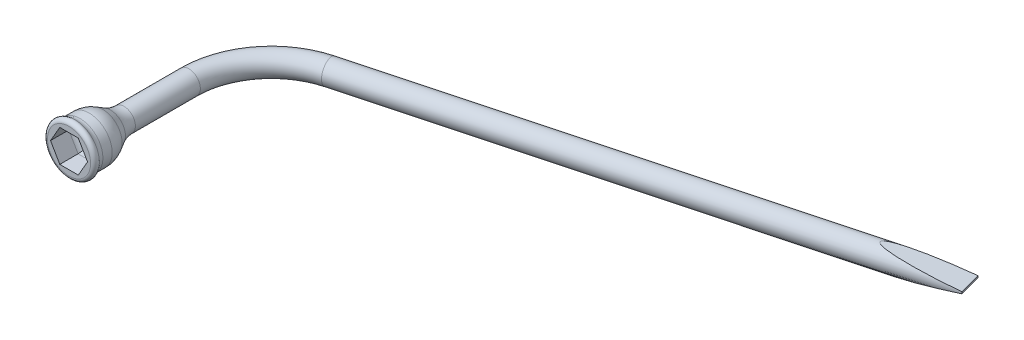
ISO-10303-21;
HEADER;
FILE_DESCRIPTION(('STEP AP214'),'2;1');
FILE_NAME('part.step','',(''),(''),'','','');
FILE_SCHEMA(('AUTOMOTIVE_DESIGN { 1 0 10303 214 1 1 1 1 }'));
ENDSEC;
DATA;
#1=APPLICATION_CONTEXT('core data for automotive mechanical design processes');
#2=APPLICATION_PROTOCOL_DEFINITION('international standard','automotive_design',2000,#1);
#3=PRODUCT_CONTEXT('',#1,'mechanical');
#4=PRODUCT('Part','Part','',(#3));
#5=PRODUCT_RELATED_PRODUCT_CATEGORY('part','',(#4));
#6=PRODUCT_DEFINITION_FORMATION('','',#4);
#7=PRODUCT_DEFINITION_CONTEXT('part definition',#1,'design');
#8=PRODUCT_DEFINITION('design','',#6,#7);
#9=PRODUCT_DEFINITION_SHAPE('','',#8);
#10=(LENGTH_UNIT() NAMED_UNIT(*) SI_UNIT(.MILLI.,.METRE.));
#11=(NAMED_UNIT(*) PLANE_ANGLE_UNIT() SI_UNIT($,.RADIAN.));
#12=(NAMED_UNIT(*) SI_UNIT($,.STERADIAN.) SOLID_ANGLE_UNIT());
#13=UNCERTAINTY_MEASURE_WITH_UNIT(LENGTH_MEASURE(1.E-05),#10,'distance_accuracy_value','');
#14=(GEOMETRIC_REPRESENTATION_CONTEXT(3) GLOBAL_UNCERTAINTY_ASSIGNED_CONTEXT((#13)) GLOBAL_UNIT_ASSIGNED_CONTEXT((#10,
#11,#12)) REPRESENTATION_CONTEXT('',''));
#15=CARTESIAN_POINT('',(0.,0.,0.));
#16=DIRECTION('',(0.,0.,1.));
#17=DIRECTION('',(1.,0.,0.));
#18=AXIS2_PLACEMENT_3D('',#15,#16,#17);
#19=CARTESIAN_POINT('',(392.552255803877,0.,-232.184059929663));
#20=DIRECTION('',(-0.965925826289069,0.,0.258819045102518));
#21=DIRECTION('',(0.258819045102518,0.,0.965925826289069));
#22=AXIS2_PLACEMENT_3D('',#19,#20,#21);
#23=PLANE('',#22);
#24=CARTESIAN_POINT('',(392.552255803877,0.,-232.184059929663));
#25=DIRECTION('',(-0.965925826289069,0.,0.258819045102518));
#26=DIRECTION('',(0.258819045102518,0.,0.965925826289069));
#27=AXIS2_PLACEMENT_3D('',#24,#25,#26);
#28=CIRCLE('',#27,7.93750000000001);
#29=CARTESIAN_POINT('',(390.504464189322,0.63499999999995,-239.826522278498));
#30=VERTEX_POINT('',#29);
#31=CARTESIAN_POINT('',(390.504464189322,-0.635,-239.826522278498));
#32=VERTEX_POINT('',#31);
#33=EDGE_CURVE('E118',#30,#32,#28,.T.);
#34=ORIENTED_EDGE('',*,*,#33,.F.);
#35=DIRECTION('',(0.258819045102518,0.,0.965925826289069));
#36=VECTOR('',#35,1.);
#37=CARTESIAN_POINT('',(363.169716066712,0.635,-341.841191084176));
#38=LINE('',#37,#36);
#39=CARTESIAN_POINT('',(394.600047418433,0.635,-224.541597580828));
#40=VERTEX_POINT('',#39);
#41=EDGE_CURVE('E65',#30,#40,#38,.T.);
#42=ORIENTED_EDGE('',*,*,#41,.T.);
#43=CARTESIAN_POINT('',(394.606631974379,0.,-224.517023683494));
#44=VERTEX_POINT('',#43);
#45=EDGE_CURVE('E115',#44,#40,#28,.T.);
#46=ORIENTED_EDGE('',*,*,#45,.F.);
#47=CARTESIAN_POINT('',(394.600047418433,-0.634999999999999,-224.541597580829));
#48=VERTEX_POINT('',#47);
#49=EDGE_CURVE('E120',#48,#44,#28,.T.);
#50=ORIENTED_EDGE('',*,*,#49,.F.);
#51=DIRECTION('',(0.258819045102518,0.,0.965925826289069));
#52=VECTOR('',#51,1.);
#53=CARTESIAN_POINT('',(363.169716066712,-0.635,-341.841191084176));
#54=LINE('',#53,#52);
#55=EDGE_CURVE('E58',#32,#48,#54,.T.);
#56=ORIENTED_EDGE('',*,*,#55,.F.);
#57=EDGE_LOOP('',(#34,#42,#46,#50,#56));
#58=FACE_BOUND('',#57,.T.);
#59=ADVANCED_FACE('F44',(#58),#23,.F.);
#60=CARTESIAN_POINT('',(0.,0.,0.));
#61=DIRECTION('',(0.,0.,-1.));
#62=DIRECTION('',(-1.,0.,0.));
#63=AXIS2_PLACEMENT_3D('',#60,#61,#62);
#64=CYLINDRICAL_SURFACE('',#63,7.93750000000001);
#65=CARTESIAN_POINT('',(0.,0.,-38.1));
#66=DIRECTION('',(0.,0.,-1.));
#67=DIRECTION('',(-1.,0.,0.));
#68=AXIS2_PLACEMENT_3D('',#65,#66,#67);
#69=CIRCLE('',#68,7.93750000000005);
#70=CARTESIAN_POINT('',(-7.93750000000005,0.,-38.1));
#71=VERTEX_POINT('',#70);
#72=EDGE_CURVE('E151',#71,#71,#69,.T.);
#73=ORIENTED_EDGE('',*,*,#72,.T.);
#74=EDGE_LOOP('',(#73));
#75=FACE_BOUND('',#74,.T.);
#76=CARTESIAN_POINT('',(0.,0.,-83.1472626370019));
#77=DIRECTION('',(0.,0.,1.));
#78=DIRECTION('',(1.,0.,0.));
#79=AXIS2_PLACEMENT_3D('',#76,#77,#78);
#80=CIRCLE('',#79,7.93750000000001);
#81=CARTESIAN_POINT('',(-7.93750000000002,0.,-83.1472626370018));
#82=VERTEX_POINT('',#81);
#83=EDGE_CURVE('E130',#82,#82,#80,.T.);
#84=ORIENTED_EDGE('',*,*,#83,.T.);
#85=EDGE_LOOP('',(#84));
#86=FACE_BOUND('',#85,.T.);
#87=ADVANCED_FACE('F314',(#75,#86),#64,.T.);
#88=CARTESIAN_POINT('',(57.15,0.,-83.1472626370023));
#89=DIRECTION('',(0.,-1.,0.));
#90=DIRECTION('',(0.,0.,-1.));
#91=AXIS2_PLACEMENT_3D('',#88,#89,#90);
#92=TOROIDAL_SURFACE('',#91,57.15,7.93750000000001);
#93=CARTESIAN_POINT('',(42.3584915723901,0.,-138.349923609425));
#94=DIRECTION('',(-0.965925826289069,0.,0.258819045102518));
#95=DIRECTION('',(0.258819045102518,0.,0.965925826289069));
#96=AXIS2_PLACEMENT_3D('',#93,#94,#95);
#97=CIRCLE('',#96,7.93750000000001);
#98=CARTESIAN_POINT('',(40.3041154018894,0.,-146.016959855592));
#99=VERTEX_POINT('',#98);
#100=EDGE_CURVE('E126',#99,#99,#97,.T.);
#101=CARTESIAN_POINT('',(57.15,0.,-83.1472626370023));
#102=DIRECTION('',(0.,-1.,0.));
#103=DIRECTION('',(0.,0.,-1.));
#104=AXIS2_PLACEMENT_3D('',#101,#102,#103);
#105=CIRCLE('',#104,65.0875);
#106=EDGE_CURVE('',#82,#99,#105,.T.);
#107=ORIENTED_EDGE('',*,*,#83,.F.);
#108=ORIENTED_EDGE('',*,*,#100,.T.);
#109=ORIENTED_EDGE('',*,*,#106,.T.);
#110=ORIENTED_EDGE('',*,*,#106,.F.);
#111=EDGE_LOOP('',(#107,#109,#108,#110));
#112=FACE_BOUND('',#111,.T.);
#113=ADVANCED_FACE('F305',(#112),#92,.T.);
#114=CARTESIAN_POINT('',(42.3584915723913,0.,-138.349923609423));
#115=DIRECTION('',(0.965925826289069,0.,-0.258819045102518));
#116=DIRECTION('',(-0.258819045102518,0.,-0.965925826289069));
#117=AXIS2_PLACEMENT_3D('',#114,#115,#116);
#118=CYLINDRICAL_SURFACE('',#117,7.93750000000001);
#119=ORIENTED_EDGE('',*,*,#45,.T.);
#120=CARTESIAN_POINT('',(396.819128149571,0.,-233.327364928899));
#121=DIRECTION('',(-0.137439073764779,-0.98982538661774,0.0368266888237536));
#122=DIRECTION('',(0.956097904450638,-0.1422873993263,-0.256185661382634));
#123=AXIS2_PLACEMENT_3D('',#120,#121,#122);
#124=ELLIPSE('',#123,55.7849819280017,7.93750000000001);
#125=EDGE_CURVE('E12',#40,#30,#124,.T.);
#126=ORIENTED_EDGE('',*,*,#125,.T.);
#127=ORIENTED_EDGE('',*,*,#33,.T.);
#128=CARTESIAN_POINT('',(396.819128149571,0.,-233.327364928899));
#129=DIRECTION('',(-0.137439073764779,0.98982538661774,0.0368266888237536));
#130=DIRECTION('',(0.956097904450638,0.1422873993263,-0.256185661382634));
#131=AXIS2_PLACEMENT_3D('',#128,#129,#130);
#132=ELLIPSE('',#131,55.7849819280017,7.93750000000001);
#133=EDGE_CURVE('E52',#32,#48,#132,.T.);
#134=ORIENTED_EDGE('',*,*,#133,.T.);
#135=ORIENTED_EDGE('',*,*,#49,.T.);
#136=EDGE_LOOP('',(#119,#126,#127,#134,#135));
#137=FACE_BOUND('',#136,.T.);
#138=ORIENTED_EDGE('',*,*,#100,.F.);
#139=EDGE_LOOP('',(#138));
#140=FACE_BOUND('',#139,.T.);
#141=ADVANCED_FACE('F123',(#137,#140),#118,.T.);
#142=CARTESIAN_POINT('',(0.,0.,-2.54));
#143=DIRECTION('',(0.,0.,-1.));
#144=DIRECTION('',(-1.,0.,0.));
#145=AXIS2_PLACEMENT_3D('',#142,#143,#144);
#146=TOROIDAL_SURFACE('',#145,14.9225,2.54);
#147=CARTESIAN_POINT('',(0.,0.,0.));
#148=DIRECTION('',(0.,0.,-1.));
#149=DIRECTION('',(-1.,0.,0.));
#150=AXIS2_PLACEMENT_3D('',#147,#148,#149);
#151=CIRCLE('',#150,14.9225);
#152=CARTESIAN_POINT('',(-14.9225,0.,0.));
#153=VERTEX_POINT('',#152);
#154=EDGE_CURVE('E133',#153,#153,#151,.T.);
#155=ORIENTED_EDGE('',*,*,#154,.T.);
#156=EDGE_LOOP('',(#155));
#157=FACE_BOUND('',#156,.T.);
#158=CARTESIAN_POINT('',(0.,0.,-3.98859097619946));
#159=DIRECTION('',(0.,0.,-1.));
#160=DIRECTION('',(-1.,0.,0.));
#161=AXIS2_PLACEMENT_3D('',#158,#159,#160);
#162=CIRCLE('',#161,17.0089285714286);
#163=CARTESIAN_POINT('',(-17.0089285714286,0.,-3.98859097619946));
#164=VERTEX_POINT('',#163);
#165=EDGE_CURVE('E136',#164,#164,#162,.T.);
#166=ORIENTED_EDGE('',*,*,#165,.F.);
#167=EDGE_LOOP('',(#166));
#168=FACE_BOUND('',#167,.T.);
#169=ADVANCED_FACE('F304',(#157,#168),#146,.T.);
#170=CARTESIAN_POINT('',(0.,0.,-7.61006841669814));
#171=DIRECTION('',(0.,0.,-1.));
#172=DIRECTION('',(-1.,0.,0.));
#173=AXIS2_PLACEMENT_3D('',#170,#171,#172);
#174=TOROIDAL_SURFACE('',#173,22.225,6.35);
#175=ORIENTED_EDGE('',*,*,#165,.T.);
#176=EDGE_LOOP('',(#175));
#177=FACE_BOUND('',#176,.T.);
#178=CARTESIAN_POINT('',(0.,0.,-7.61006841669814));
#179=DIRECTION('',(0.,0.,-1.));
#180=DIRECTION('',(-1.,0.,0.));
#181=AXIS2_PLACEMENT_3D('',#178,#179,#180);
#182=CIRCLE('',#181,15.875);
#183=CARTESIAN_POINT('',(-15.875,0.,-7.61006841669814));
#184=VERTEX_POINT('',#183);
#185=EDGE_CURVE('E139',#184,#184,#182,.T.);
#186=ORIENTED_EDGE('',*,*,#185,.F.);
#187=EDGE_LOOP('',(#186));
#188=FACE_BOUND('',#187,.T.);
#189=ADVANCED_FACE('F311',(#177,#188),#174,.F.);
#190=CARTESIAN_POINT('',(0.,0.,0.));
#191=DIRECTION('',(0.,0.,-1.));
#192=DIRECTION('',(-1.,0.,0.));
#193=AXIS2_PLACEMENT_3D('',#190,#191,#192);
#194=CYLINDRICAL_SURFACE('',#193,15.875);
#195=ORIENTED_EDGE('',*,*,#185,.T.);
#196=EDGE_LOOP('',(#195));
#197=FACE_BOUND('',#196,.T.);
#198=CARTESIAN_POINT('',(0.,0.,-14.0368421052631));
#199=DIRECTION('',(0.,0.,-1.));
#200=DIRECTION('',(-1.,0.,0.));
#201=AXIS2_PLACEMENT_3D('',#198,#199,#200);
#202=CIRCLE('',#201,15.875);
#203=CARTESIAN_POINT('',(-15.875,0.,-14.0368421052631));
#204=VERTEX_POINT('',#203);
#205=EDGE_CURVE('E142',#204,#204,#202,.T.);
#206=ORIENTED_EDGE('',*,*,#205,.F.);
#207=EDGE_LOOP('',(#206));
#208=FACE_BOUND('',#207,.T.);
#209=ADVANCED_FACE('F329',(#197,#208),#194,.T.);
#210=CARTESIAN_POINT('',(0.,0.,-14.0368421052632));
#211=DIRECTION('',(0.,0.,-1.));
#212=DIRECTION('',(-1.,0.,0.));
#213=AXIS2_PLACEMENT_3D('',#210,#211,#212);
#214=DEGENERATE_TOROIDAL_SURFACE('',#213,3.175,19.05,.F.);
#215=ORIENTED_EDGE('',*,*,#205,.T.);
#216=EDGE_LOOP('',(#215));
#217=FACE_BOUND('',#216,.T.);
#218=CARTESIAN_POINT('',(0.,0.,-23.4137851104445));
#219=DIRECTION('',(0.,0.,-1.));
#220=DIRECTION('',(-1.,0.,0.));
#221=AXIS2_PLACEMENT_3D('',#218,#219,#220);
#222=CIRCLE('',#221,13.4073834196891);
#223=CARTESIAN_POINT('',(-13.4073834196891,0.,-23.4137851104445));
#224=VERTEX_POINT('',#223);
#225=EDGE_CURVE('E145',#224,#224,#222,.T.);
#226=ORIENTED_EDGE('',*,*,#225,.F.);
#227=EDGE_LOOP('',(#226));
#228=FACE_BOUND('',#227,.T.);
#229=ADVANCED_FACE('F333',(#217,#228),#214,.F.);
#230=CARTESIAN_POINT('',(0.,0.,-28.7230569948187));
#231=DIRECTION('',(0.,0.,1.));
#232=DIRECTION('',(1.,0.,0.));
#233=AXIS2_PLACEMENT_3D('',#230,#231,#232);
#234=CONICAL_SURFACE('',#233,10.4051165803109,0.514647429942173);
#235=ORIENTED_EDGE('',*,*,#225,.T.);
#236=EDGE_LOOP('',(#235));
#237=FACE_BOUND('',#236,.T.);
#238=CARTESIAN_POINT('',(0.,0.,-28.7230569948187));
#239=DIRECTION('',(0.,0.,-1.));
#240=DIRECTION('',(-1.,0.,0.));
#241=AXIS2_PLACEMENT_3D('',#238,#239,#240);
#242=CIRCLE('',#241,10.4051165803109);
#243=CARTESIAN_POINT('',(-10.4051165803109,0.,-28.7230569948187));
#244=VERTEX_POINT('',#243);
#245=EDGE_CURVE('E148',#244,#244,#242,.T.);
#246=ORIENTED_EDGE('',*,*,#245,.F.);
#247=EDGE_LOOP('',(#246));
#248=FACE_BOUND('',#247,.T.);
#249=ADVANCED_FACE('F337',(#237,#248),#234,.T.);
#250=CARTESIAN_POINT('',(0.,0.,-38.1));
#251=DIRECTION('',(0.,0.,-1.));
#252=DIRECTION('',(-1.,0.,0.));
#253=AXIS2_PLACEMENT_3D('',#250,#251,#252);
#254=TOROIDAL_SURFACE('',#253,26.9875000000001,19.05);
#255=ORIENTED_EDGE('',*,*,#245,.T.);
#256=EDGE_LOOP('',(#255));
#257=FACE_BOUND('',#256,.T.);
#258=ORIENTED_EDGE('',*,*,#72,.F.);
#259=EDGE_LOOP('',(#258));
#260=FACE_BOUND('',#259,.T.);
#261=ADVANCED_FACE('F341',(#257,#260),#254,.F.);
#262=CARTESIAN_POINT('',(0.,0.,0.));
#263=DIRECTION('',(0.,0.,1.));
#264=DIRECTION('',(1.,0.,0.));
#265=AXIS2_PLACEMENT_3D('',#262,#263,#264);
#266=PLANE('',#265);
#267=DIRECTION('',(-0.5,0.866025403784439,0.));
#268=VECTOR('',#267,1.);
#269=CARTESIAN_POINT('',(12.8316097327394,0.,0.));
#270=LINE('',#269,#268);
#271=CARTESIAN_POINT('',(12.8316097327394,0.,0.));
#272=VERTEX_POINT('',#271);
#273=CARTESIAN_POINT('',(6.41580486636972,11.1125,0.));
#274=VERTEX_POINT('',#273);
#275=EDGE_CURVE('E184',#272,#274,#270,.T.);
#276=ORIENTED_EDGE('',*,*,#275,.F.);
#277=DIRECTION('',(0.5,0.866025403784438,0.));
#278=VECTOR('',#277,1.);
#279=CARTESIAN_POINT('',(6.41580486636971,-11.1125,0.));
#280=LINE('',#279,#278);
#281=CARTESIAN_POINT('',(6.41580486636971,-11.1125,0.));
#282=VERTEX_POINT('',#281);
#283=EDGE_CURVE('E168',#282,#272,#280,.T.);
#284=ORIENTED_EDGE('',*,*,#283,.F.);
#285=DIRECTION('',(1.,0.,0.));
#286=VECTOR('',#285,1.);
#287=CARTESIAN_POINT('',(-6.41580486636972,-11.1125,0.));
#288=LINE('',#287,#286);
#289=CARTESIAN_POINT('',(-6.41580486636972,-11.1125,0.));
#290=VERTEX_POINT('',#289);
#291=EDGE_CURVE('E172',#290,#282,#288,.T.);
#292=ORIENTED_EDGE('',*,*,#291,.F.);
#293=DIRECTION('',(0.5,-0.866025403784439,0.));
#294=VECTOR('',#293,1.);
#295=CARTESIAN_POINT('',(-12.8316097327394,0.,0.));
#296=LINE('',#295,#294);
#297=CARTESIAN_POINT('',(-12.8316097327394,0.,0.));
#298=VERTEX_POINT('',#297);
#299=EDGE_CURVE('E175',#298,#290,#296,.T.);
#300=ORIENTED_EDGE('',*,*,#299,.F.);
#301=DIRECTION('',(-0.5,-0.866025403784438,0.));
#302=VECTOR('',#301,1.);
#303=CARTESIAN_POINT('',(-6.41580486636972,11.1125,0.));
#304=LINE('',#303,#302);
#305=CARTESIAN_POINT('',(-6.41580486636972,11.1125,0.));
#306=VERTEX_POINT('',#305);
#307=EDGE_CURVE('E178',#306,#298,#304,.T.);
#308=ORIENTED_EDGE('',*,*,#307,.F.);
#309=DIRECTION('',(-1.,0.,0.));
#310=VECTOR('',#309,1.);
#311=CARTESIAN_POINT('',(6.41580486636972,11.1125,0.));
#312=LINE('',#311,#310);
#313=EDGE_CURVE('E181',#274,#306,#312,.T.);
#314=ORIENTED_EDGE('',*,*,#313,.F.);
#315=EDGE_LOOP('',(#276,#284,#292,#300,#308,#314));
#316=FACE_BOUND('',#315,.T.);
#317=ORIENTED_EDGE('',*,*,#154,.F.);
#318=EDGE_LOOP('',(#317));
#319=FACE_BOUND('',#318,.T.);
#320=ADVANCED_FACE('F46',(#316,#319),#266,.T.);
#321=CARTESIAN_POINT('',(12.8316097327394,0.,-12.7));
#322=DIRECTION('',(0.866025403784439,0.5,0.));
#323=DIRECTION('',(-0.5,0.866025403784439,0.));
#324=AXIS2_PLACEMENT_3D('',#321,#322,#323);
#325=PLANE('',#324);
#326=ORIENTED_EDGE('',*,*,#275,.T.);
#327=DIRECTION('',(0.,0.,1.));
#328=VECTOR('',#327,1.);
#329=CARTESIAN_POINT('',(6.41580486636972,11.1125,-12.7));
#330=LINE('',#329,#328);
#331=CARTESIAN_POINT('',(6.41580486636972,11.1125,-12.7));
#332=VERTEX_POINT('',#331);
#333=EDGE_CURVE('E155',#332,#274,#330,.T.);
#334=ORIENTED_EDGE('',*,*,#333,.F.);
#335=DIRECTION('',(-0.5,0.866025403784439,0.));
#336=VECTOR('',#335,1.);
#337=CARTESIAN_POINT('',(12.8316097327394,0.,-12.7));
#338=LINE('',#337,#336);
#339=CARTESIAN_POINT('',(12.8316097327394,0.,-12.7));
#340=VERTEX_POINT('',#339);
#341=EDGE_CURVE('E171',#340,#332,#338,.T.);
#342=ORIENTED_EDGE('',*,*,#341,.F.);
#343=DIRECTION('',(0.,0.,1.));
#344=VECTOR('',#343,1.);
#345=CARTESIAN_POINT('',(12.8316097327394,0.,-12.7));
#346=LINE('',#345,#344);
#347=EDGE_CURVE('E154',#340,#272,#346,.T.);
#348=ORIENTED_EDGE('',*,*,#347,.T.);
#349=EDGE_LOOP('',(#326,#334,#342,#348));
#350=FACE_BOUND('',#349,.T.);
#351=ADVANCED_FACE('F264',(#350),#325,.F.);
#352=CARTESIAN_POINT('',(6.41580486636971,-11.1125,-12.7));
#353=DIRECTION('',(0.866025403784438,-0.5,0.));
#354=DIRECTION('',(0.5,0.866025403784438,0.));
#355=AXIS2_PLACEMENT_3D('',#352,#353,#354);
#356=PLANE('',#355);
#357=ORIENTED_EDGE('',*,*,#283,.T.);
#358=ORIENTED_EDGE('',*,*,#347,.F.);
#359=DIRECTION('',(0.5,0.866025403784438,0.));
#360=VECTOR('',#359,1.);
#361=CARTESIAN_POINT('',(6.41580486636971,-11.1125,-12.7));
#362=LINE('',#361,#360);
#363=CARTESIAN_POINT('',(6.41580486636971,-11.1125,-12.7));
#364=VERTEX_POINT('',#363);
#365=EDGE_CURVE('E159',#364,#340,#362,.T.);
#366=ORIENTED_EDGE('',*,*,#365,.F.);
#367=DIRECTION('',(0.,0.,1.));
#368=VECTOR('',#367,1.);
#369=CARTESIAN_POINT('',(6.41580486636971,-11.1125,-12.7));
#370=LINE('',#369,#368);
#371=EDGE_CURVE('E165',#364,#282,#370,.T.);
#372=ORIENTED_EDGE('',*,*,#371,.T.);
#373=EDGE_LOOP('',(#357,#358,#366,#372));
#374=FACE_BOUND('',#373,.T.);
#375=ADVANCED_FACE('F260',(#374),#356,.F.);
#376=CARTESIAN_POINT('',(-6.41580486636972,-11.1125,-12.7));
#377=DIRECTION('',(0.,-1.,0.));
#378=DIRECTION('',(1.,0.,0.));
#379=AXIS2_PLACEMENT_3D('',#376,#377,#378);
#380=PLANE('',#379);
#381=ORIENTED_EDGE('',*,*,#291,.T.);
#382=ORIENTED_EDGE('',*,*,#371,.F.);
#383=DIRECTION('',(1.,0.,0.));
#384=VECTOR('',#383,1.);
#385=CARTESIAN_POINT('',(-6.41580486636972,-11.1125,-12.7));
#386=LINE('',#385,#384);
#387=CARTESIAN_POINT('',(-6.41580486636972,-11.1125,-12.7));
#388=VERTEX_POINT('',#387);
#389=EDGE_CURVE('E189',#388,#364,#386,.T.);
#390=ORIENTED_EDGE('',*,*,#389,.F.);
#391=DIRECTION('',(0.,0.,1.));
#392=VECTOR('',#391,1.);
#393=CARTESIAN_POINT('',(-6.41580486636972,-11.1125,-12.7));
#394=LINE('',#393,#392);
#395=EDGE_CURVE('E163',#388,#290,#394,.T.);
#396=ORIENTED_EDGE('',*,*,#395,.T.);
#397=EDGE_LOOP('',(#381,#382,#390,#396));
#398=FACE_BOUND('',#397,.T.);
#399=ADVANCED_FACE('F280',(#398),#380,.F.);
#400=CARTESIAN_POINT('',(-12.8316097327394,0.,-12.7));
#401=DIRECTION('',(-0.866025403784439,-0.5,0.));
#402=DIRECTION('',(0.5,-0.866025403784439,0.));
#403=AXIS2_PLACEMENT_3D('',#400,#401,#402);
#404=PLANE('',#403);
#405=ORIENTED_EDGE('',*,*,#299,.T.);
#406=ORIENTED_EDGE('',*,*,#395,.F.);
#407=DIRECTION('',(0.5,-0.866025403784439,0.));
#408=VECTOR('',#407,1.);
#409=CARTESIAN_POINT('',(-12.8316097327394,0.,-12.7));
#410=LINE('',#409,#408);
#411=CARTESIAN_POINT('',(-12.8316097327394,0.,-12.7));
#412=VERTEX_POINT('',#411);
#413=EDGE_CURVE('E191',#412,#388,#410,.T.);
#414=ORIENTED_EDGE('',*,*,#413,.F.);
#415=DIRECTION('',(0.,0.,1.));
#416=VECTOR('',#415,1.);
#417=CARTESIAN_POINT('',(-12.8316097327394,0.,-12.7));
#418=LINE('',#417,#416);
#419=EDGE_CURVE('E161',#412,#298,#418,.T.);
#420=ORIENTED_EDGE('',*,*,#419,.T.);
#421=EDGE_LOOP('',(#405,#406,#414,#420));
#422=FACE_BOUND('',#421,.T.);
#423=ADVANCED_FACE('F291',(#422),#404,.F.);
#424=CARTESIAN_POINT('',(-6.41580486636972,11.1125,-12.7));
#425=DIRECTION('',(-0.866025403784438,0.5,0.));
#426=DIRECTION('',(-0.5,-0.866025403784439,0.));
#427=AXIS2_PLACEMENT_3D('',#424,#425,#426);
#428=PLANE('',#427);
#429=ORIENTED_EDGE('',*,*,#307,.T.);
#430=ORIENTED_EDGE('',*,*,#419,.F.);
#431=DIRECTION('',(-0.5,-0.866025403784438,0.));
#432=VECTOR('',#431,1.);
#433=CARTESIAN_POINT('',(-6.41580486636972,11.1125,-12.7));
#434=LINE('',#433,#432);
#435=CARTESIAN_POINT('',(-6.41580486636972,11.1125,-12.7));
#436=VERTEX_POINT('',#435);
#437=EDGE_CURVE('E194',#436,#412,#434,.T.);
#438=ORIENTED_EDGE('',*,*,#437,.F.);
#439=DIRECTION('',(0.,0.,1.));
#440=VECTOR('',#439,1.);
#441=CARTESIAN_POINT('',(-6.41580486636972,11.1125,-12.7));
#442=LINE('',#441,#440);
#443=EDGE_CURVE('E158',#436,#306,#442,.T.);
#444=ORIENTED_EDGE('',*,*,#443,.T.);
#445=EDGE_LOOP('',(#429,#430,#438,#444));
#446=FACE_BOUND('',#445,.T.);
#447=ADVANCED_FACE('F288',(#446),#428,.F.);
#448=CARTESIAN_POINT('',(6.41580486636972,11.1125,-12.7));
#449=DIRECTION('',(0.,1.,0.));
#450=DIRECTION('',(0.,0.,1.));
#451=AXIS2_PLACEMENT_3D('',#448,#449,#450);
#452=PLANE('',#451);
#453=ORIENTED_EDGE('',*,*,#313,.T.);
#454=ORIENTED_EDGE('',*,*,#443,.F.);
#455=DIRECTION('',(-1.,0.,0.));
#456=VECTOR('',#455,1.);
#457=CARTESIAN_POINT('',(6.41580486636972,11.1125,-12.7));
#458=LINE('',#457,#456);
#459=EDGE_CURVE('E197',#332,#436,#458,.T.);
#460=ORIENTED_EDGE('',*,*,#459,.F.);
#461=ORIENTED_EDGE('',*,*,#333,.T.);
#462=EDGE_LOOP('',(#453,#454,#460,#461));
#463=FACE_BOUND('',#462,.T.);
#464=ADVANCED_FACE('F269',(#463),#452,.F.);
#465=CARTESIAN_POINT('',(-6.41580486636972,-11.1125,-12.7));
#466=CARTESIAN_POINT('',(-6.09501462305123,-10.556875,-19.05));
#467=CARTESIAN_POINT('',(0.,0.,-19.05));
#468=CARTESIAN_POINT('',(6.41580486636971,-11.1125,-12.7));
#469=CARTESIAN_POINT('',(6.09501462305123,-10.556875,-19.05));
#470=CARTESIAN_POINT('',(0.,0.,-19.05));
#471=(BOUNDED_SURFACE() B_SPLINE_SURFACE(1,2,((#465,#466,#467),(#468,#469,#470)),.UNSPECIFIED.,
.F.,.F.,.F.) B_SPLINE_SURFACE_WITH_KNOTS((2,2),(3,3),(0.,1.),(0.,1.),
.UNSPECIFIED.) GEOMETRIC_REPRESENTATION_ITEM() RATIONAL_B_SPLINE_SURFACE(((1.,1.,1.),(1.,1.,1.))) REPRESENTATION_ITEM('') SURFACE());
#472=CARTESIAN_POINT('',(6.41580486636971,-11.1125,-12.7));
#473=CARTESIAN_POINT('',(6.09501462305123,-10.556875,-19.05));
#474=CARTESIAN_POINT('',(0.,0.,-19.05));
#475=(BOUNDED_CURVE() B_SPLINE_CURVE(2,(#472,#473,#474),.UNSPECIFIED.,.F.,
.F.) B_SPLINE_CURVE_WITH_KNOTS((3,3),(0.,1.),
.UNSPECIFIED.) CURVE() GEOMETRIC_REPRESENTATION_ITEM() RATIONAL_B_SPLINE_CURVE((1.,1.,1.)) REPRESENTATION_ITEM(''));
#476=CARTESIAN_POINT('',(0.,0.,-19.05));
#477=VERTEX_POINT('',#476);
#478=EDGE_CURVE('E186',#364,#477,#475,.T.);
#479=CARTESIAN_POINT('',(-6.41580486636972,-11.1125,-12.7));
#480=CARTESIAN_POINT('',(-6.09501462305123,-10.556875,-19.05));
#481=CARTESIAN_POINT('',(0.,0.,-19.05));
#482=(BOUNDED_CURVE() B_SPLINE_CURVE(2,(#479,#480,#481),.UNSPECIFIED.,.F.,
.F.) B_SPLINE_CURVE_WITH_KNOTS((3,3),(0.,1.),
.UNSPECIFIED.) CURVE() GEOMETRIC_REPRESENTATION_ITEM() RATIONAL_B_SPLINE_CURVE((1.,1.,1.)) REPRESENTATION_ITEM(''));
#483=EDGE_CURVE('E206',#388,#477,#482,.T.);
#484=ORIENTED_EDGE('',*,*,#389,.T.);
#485=ORIENTED_EDGE('',*,*,#478,.T.);
#486=ORIENTED_EDGE('',*,*,#483,.F.);
#487=EDGE_LOOP('',(#484,#485,#486));
#488=FACE_BOUND('',#487,.T.);
#489=ADVANCED_FACE('F277',(#488),#471,.T.);
#490=CARTESIAN_POINT('',(-12.8316097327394,0.,-12.7));
#491=CARTESIAN_POINT('',(-12.1900292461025,0.,-19.05));
#492=CARTESIAN_POINT('',(0.,0.,-19.05));
#493=CARTESIAN_POINT('',(-6.41580486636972,-11.1125,-12.7));
#494=CARTESIAN_POINT('',(-6.09501462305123,-10.556875,-19.05));
#495=CARTESIAN_POINT('',(0.,0.,-19.05));
#496=(BOUNDED_SURFACE() B_SPLINE_SURFACE(1,2,((#490,#491,#492),(#493,#494,#495)),.UNSPECIFIED.,
.F.,.F.,.F.) B_SPLINE_SURFACE_WITH_KNOTS((2,2),(3,3),(0.,1.),(0.,1.),
.UNSPECIFIED.) GEOMETRIC_REPRESENTATION_ITEM() RATIONAL_B_SPLINE_SURFACE(((1.,1.,1.),(1.,1.,1.))) REPRESENTATION_ITEM('') SURFACE());
#497=CARTESIAN_POINT('',(-12.8316097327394,0.,-12.7));
#498=CARTESIAN_POINT('',(-12.1900292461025,0.,-19.05));
#499=CARTESIAN_POINT('',(0.,0.,-19.05));
#500=(BOUNDED_CURVE() B_SPLINE_CURVE(2,(#497,#498,#499),.UNSPECIFIED.,.F.,
.F.) B_SPLINE_CURVE_WITH_KNOTS((3,3),(0.,1.),
.UNSPECIFIED.) CURVE() GEOMETRIC_REPRESENTATION_ITEM() RATIONAL_B_SPLINE_CURVE((1.,1.,1.)) REPRESENTATION_ITEM(''));
#501=EDGE_CURVE('E213',#412,#477,#500,.T.);
#502=ORIENTED_EDGE('',*,*,#413,.T.);
#503=ORIENTED_EDGE('',*,*,#483,.T.);
#504=ORIENTED_EDGE('',*,*,#501,.F.);
#505=EDGE_LOOP('',(#502,#503,#504));
#506=FACE_BOUND('',#505,.T.);
#507=ADVANCED_FACE('F292',(#506),#496,.T.);
#508=CARTESIAN_POINT('',(-6.41580486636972,11.1125,-12.7));
#509=CARTESIAN_POINT('',(-6.09501462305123,10.556875,-19.05));
#510=CARTESIAN_POINT('',(0.,0.,-19.05));
#511=CARTESIAN_POINT('',(-12.8316097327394,0.,-12.7));
#512=CARTESIAN_POINT('',(-12.1900292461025,0.,-19.05));
#513=CARTESIAN_POINT('',(0.,0.,-19.05));
#514=(BOUNDED_SURFACE() B_SPLINE_SURFACE(1,2,((#508,#509,#510),(#511,#512,#513)),.UNSPECIFIED.,
.F.,.F.,.F.) B_SPLINE_SURFACE_WITH_KNOTS((2,2),(3,3),(0.,1.),(0.,1.),
.UNSPECIFIED.) GEOMETRIC_REPRESENTATION_ITEM() RATIONAL_B_SPLINE_SURFACE(((1.,1.,1.),(1.,1.,1.))) REPRESENTATION_ITEM('') SURFACE());
#515=CARTESIAN_POINT('',(-6.41580486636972,11.1125,-12.7));
#516=CARTESIAN_POINT('',(-6.09501462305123,10.556875,-19.05));
#517=CARTESIAN_POINT('',(0.,0.,-19.05));
#518=(BOUNDED_CURVE() B_SPLINE_CURVE(2,(#515,#516,#517),.UNSPECIFIED.,.F.,
.F.) B_SPLINE_CURVE_WITH_KNOTS((3,3),(0.,1.),
.UNSPECIFIED.) CURVE() GEOMETRIC_REPRESENTATION_ITEM() RATIONAL_B_SPLINE_CURVE((1.,1.,1.)) REPRESENTATION_ITEM(''));
#519=EDGE_CURVE('E221',#436,#477,#518,.T.);
#520=ORIENTED_EDGE('',*,*,#437,.T.);
#521=ORIENTED_EDGE('',*,*,#501,.T.);
#522=ORIENTED_EDGE('',*,*,#519,.F.);
#523=EDGE_LOOP('',(#520,#521,#522));
#524=FACE_BOUND('',#523,.T.);
#525=ADVANCED_FACE('F273',(#524),#514,.T.);
#526=CARTESIAN_POINT('',(6.41580486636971,-11.1125,-12.7));
#527=CARTESIAN_POINT('',(6.09501462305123,-10.556875,-19.05));
#528=CARTESIAN_POINT('',(0.,0.,-19.05));
#529=CARTESIAN_POINT('',(12.8316097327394,0.,-12.7));
#530=CARTESIAN_POINT('',(12.1900292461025,0.,-19.05));
#531=CARTESIAN_POINT('',(0.,0.,-19.05));
#532=(BOUNDED_SURFACE() B_SPLINE_SURFACE(1,2,((#526,#527,#528),(#529,#530,#531)),.UNSPECIFIED.,
.F.,.F.,.F.) B_SPLINE_SURFACE_WITH_KNOTS((2,2),(3,3),(0.,1.),(0.,1.),
.UNSPECIFIED.) GEOMETRIC_REPRESENTATION_ITEM() RATIONAL_B_SPLINE_SURFACE(((1.,1.,1.),(1.,1.,1.))) REPRESENTATION_ITEM('') SURFACE());
#533=CARTESIAN_POINT('',(12.8316097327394,0.,-12.7));
#534=CARTESIAN_POINT('',(12.1900292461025,0.,-19.05));
#535=CARTESIAN_POINT('',(0.,0.,-19.05));
#536=(BOUNDED_CURVE() B_SPLINE_CURVE(2,(#533,#534,#535),.UNSPECIFIED.,.F.,
.F.) B_SPLINE_CURVE_WITH_KNOTS((3,3),(0.,1.),
.UNSPECIFIED.) CURVE() GEOMETRIC_REPRESENTATION_ITEM() RATIONAL_B_SPLINE_CURVE((1.,1.,1.)) REPRESENTATION_ITEM(''));
#537=EDGE_CURVE('E230',#477,#340,#536,.F.);
#538=ORIENTED_EDGE('',*,*,#365,.T.);
#539=ORIENTED_EDGE('',*,*,#537,.F.);
#540=ORIENTED_EDGE('',*,*,#478,.F.);
#541=EDGE_LOOP('',(#538,#539,#540));
#542=FACE_BOUND('',#541,.T.);
#543=ADVANCED_FACE('F255',(#542),#532,.T.);
#544=CARTESIAN_POINT('',(6.41580486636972,11.1125,-12.7));
#545=CARTESIAN_POINT('',(6.09501462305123,10.556875,-19.05));
#546=CARTESIAN_POINT('',(0.,0.,-19.05));
#547=CARTESIAN_POINT('',(-6.41580486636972,11.1125,-12.7));
#548=CARTESIAN_POINT('',(-6.09501462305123,10.556875,-19.05));
#549=CARTESIAN_POINT('',(0.,0.,-19.05));
#550=(BOUNDED_SURFACE() B_SPLINE_SURFACE(1,2,((#544,#545,#546),(#547,#548,#549)),.UNSPECIFIED.,
.F.,.F.,.F.) B_SPLINE_SURFACE_WITH_KNOTS((2,2),(3,3),(0.,1.),(0.,1.),
.UNSPECIFIED.) GEOMETRIC_REPRESENTATION_ITEM() RATIONAL_B_SPLINE_SURFACE(((1.,1.,1.),(1.,1.,1.))) REPRESENTATION_ITEM('') SURFACE());
#551=CARTESIAN_POINT('',(6.41580486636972,11.1125,-12.7));
#552=CARTESIAN_POINT('',(6.09501462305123,10.556875,-19.05));
#553=CARTESIAN_POINT('',(0.,0.,-19.05));
#554=(BOUNDED_CURVE() B_SPLINE_CURVE(2,(#551,#552,#553),.UNSPECIFIED.,.F.,
.F.) B_SPLINE_CURVE_WITH_KNOTS((3,3),(0.,1.),
.UNSPECIFIED.) CURVE() GEOMETRIC_REPRESENTATION_ITEM() RATIONAL_B_SPLINE_CURVE((1.,1.,1.)) REPRESENTATION_ITEM(''));
#555=EDGE_CURVE('E229',#332,#477,#554,.T.);
#556=ORIENTED_EDGE('',*,*,#459,.T.);
#557=ORIENTED_EDGE('',*,*,#519,.T.);
#558=ORIENTED_EDGE('',*,*,#555,.F.);
#559=EDGE_LOOP('',(#556,#557,#558));
#560=FACE_BOUND('',#559,.T.);
#561=ADVANCED_FACE('F271',(#560),#550,.T.);
#562=CARTESIAN_POINT('',(12.8316097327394,0.,-12.7));
#563=CARTESIAN_POINT('',(12.1900292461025,0.,-19.05));
#564=CARTESIAN_POINT('',(0.,0.,-19.05));
#565=CARTESIAN_POINT('',(6.41580486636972,11.1125,-12.7));
#566=CARTESIAN_POINT('',(6.09501462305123,10.556875,-19.05));
#567=CARTESIAN_POINT('',(0.,0.,-19.05));
#568=(BOUNDED_SURFACE() B_SPLINE_SURFACE(1,2,((#562,#563,#564),(#565,#566,#567)),.UNSPECIFIED.,
.F.,.F.,.F.) B_SPLINE_SURFACE_WITH_KNOTS((2,2),(3,3),(0.,1.),(0.,1.),
.UNSPECIFIED.) GEOMETRIC_REPRESENTATION_ITEM() RATIONAL_B_SPLINE_SURFACE(((1.,1.,1.),(1.,1.,1.))) REPRESENTATION_ITEM('') SURFACE());
#569=ORIENTED_EDGE('',*,*,#341,.T.);
#570=ORIENTED_EDGE('',*,*,#555,.T.);
#571=ORIENTED_EDGE('',*,*,#537,.T.);
#572=EDGE_LOOP('',(#569,#570,#571));
#573=FACE_BOUND('',#572,.T.);
#574=ADVANCED_FACE('F249',(#573),#568,.T.);
#575=CARTESIAN_POINT('',(363.169716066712,-0.635,-341.841191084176));
#576=DIRECTION('',(-0.137439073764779,0.98982538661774,0.0368266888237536));
#577=DIRECTION('',(-0.990497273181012,-0.1375323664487,0.));
#578=AXIS2_PLACEMENT_3D('',#575,#576,#577);
#579=PLANE('',#578);
#580=ORIENTED_EDGE('',*,*,#55,.T.);
#581=ORIENTED_EDGE('',*,*,#133,.F.);
#582=EDGE_LOOP('',(#580,#581));
#583=FACE_BOUND('',#582,.T.);
#584=ADVANCED_FACE('F111',(#583),#579,.F.);
#585=CARTESIAN_POINT('',(363.169716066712,0.635,-341.841191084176));
#586=DIRECTION('',(-0.137439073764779,-0.98982538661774,0.0368266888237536));
#587=DIRECTION('',(0.990497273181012,-0.1375323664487,0.));
#588=AXIS2_PLACEMENT_3D('',#585,#586,#587);
#589=PLANE('',#588);
#590=ORIENTED_EDGE('',*,*,#41,.F.);
#591=ORIENTED_EDGE('',*,*,#125,.F.);
#592=EDGE_LOOP('',(#590,#591));
#593=FACE_BOUND('',#592,.T.);
#594=ADVANCED_FACE('F444',(#593),#589,.F.);
#595=CLOSED_SHELL('',(#59,#87,#113,#141,#169,#189,#209,#229,#249,#261,#320,#351,#375,#399,#423,
#447,#464,#489,#507,#525,#543,#561,#574,#584,#594));
#596=MANIFOLD_SOLID_BREP('B2',#595);
#597=ADVANCED_BREP_SHAPE_REPRESENTATION('',(#18,#596),#14);
#598=SHAPE_DEFINITION_REPRESENTATION(#9,#597);
ENDSEC;
END-ISO-10303-21;
